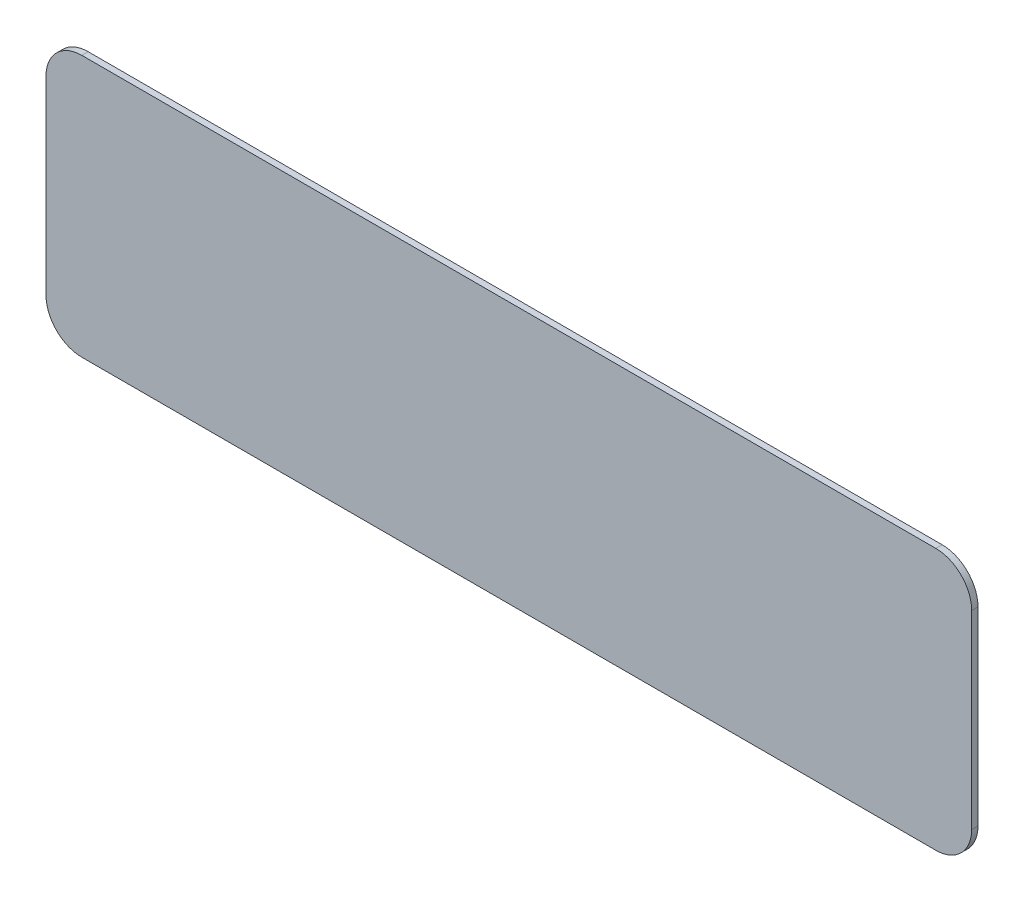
ISO-10303-21;
HEADER;
FILE_DESCRIPTION(('STEP AP214'),'2;1');
FILE_NAME('part.step','',(''),(''),'','','');
FILE_SCHEMA(('AUTOMOTIVE_DESIGN { 1 0 10303 214 1 1 1 1 }'));
ENDSEC;
DATA;
#1=APPLICATION_CONTEXT('core data for automotive mechanical design processes');
#2=APPLICATION_PROTOCOL_DEFINITION('international standard','automotive_design',2000,#1);
#3=PRODUCT_CONTEXT('',#1,'mechanical');
#4=PRODUCT('Part','Part','',(#3));
#5=PRODUCT_RELATED_PRODUCT_CATEGORY('part','',(#4));
#6=PRODUCT_DEFINITION_FORMATION('','',#4);
#7=PRODUCT_DEFINITION_CONTEXT('part definition',#1,'design');
#8=PRODUCT_DEFINITION('design','',#6,#7);
#9=PRODUCT_DEFINITION_SHAPE('','',#8);
#10=(LENGTH_UNIT() NAMED_UNIT(*) SI_UNIT(.MILLI.,.METRE.));
#11=(NAMED_UNIT(*) PLANE_ANGLE_UNIT() SI_UNIT($,.RADIAN.));
#12=(NAMED_UNIT(*) SI_UNIT($,.STERADIAN.) SOLID_ANGLE_UNIT());
#13=UNCERTAINTY_MEASURE_WITH_UNIT(LENGTH_MEASURE(1.E-05),#10,'distance_accuracy_value','');
#14=(GEOMETRIC_REPRESENTATION_CONTEXT(3) GLOBAL_UNCERTAINTY_ASSIGNED_CONTEXT((#13)) GLOBAL_UNIT_ASSIGNED_CONTEXT((#10,
#11,#12)) REPRESENTATION_CONTEXT('',''));
#15=CARTESIAN_POINT('',(0.,0.,0.));
#16=DIRECTION('',(0.,0.,1.));
#17=DIRECTION('',(1.,0.,0.));
#18=AXIS2_PLACEMENT_3D('',#15,#16,#17);
#19=CARTESIAN_POINT('',(0.,0.,0.6));
#20=DIRECTION('',(0.,0.,1.));
#21=DIRECTION('',(1.,0.,0.));
#22=AXIS2_PLACEMENT_3D('',#19,#20,#21);
#23=PLANE('',#22);
#24=DIRECTION('',(0.,-1.,0.));
#25=VECTOR('',#24,1.);
#26=CARTESIAN_POINT('',(-43.9,3.96,0.6));
#27=LINE('',#26,#25);
#28=CARTESIAN_POINT('',(-43.9,3.96,0.6));
#29=VERTEX_POINT('',#28);
#30=CARTESIAN_POINT('',(-43.9,-14.04,0.6));
#31=VERTEX_POINT('',#30);
#32=EDGE_CURVE('E11',#29,#31,#27,.T.);
#33=ORIENTED_EDGE('',*,*,#32,.T.);
#34=CARTESIAN_POINT('',(-40.5,-14.04,0.6));
#35=DIRECTION('',(0.,0.,1.));
#36=DIRECTION('',(-1.,0.,0.));
#37=AXIS2_PLACEMENT_3D('',#34,#35,#36);
#38=CIRCLE('',#37,3.4);
#39=CARTESIAN_POINT('',(-40.5,-17.44,0.6));
#40=VERTEX_POINT('',#39);
#41=EDGE_CURVE('E46',#31,#40,#38,.T.);
#42=ORIENTED_EDGE('',*,*,#41,.T.);
#43=DIRECTION('',(1.,0.,0.));
#44=VECTOR('',#43,1.);
#45=CARTESIAN_POINT('',(-40.5,-17.44,0.6));
#46=LINE('',#45,#44);
#47=CARTESIAN_POINT('',(40.5,-17.44,0.6));
#48=VERTEX_POINT('',#47);
#49=EDGE_CURVE('E103',#40,#48,#46,.T.);
#50=ORIENTED_EDGE('',*,*,#49,.T.);
#51=CARTESIAN_POINT('',(40.5,-14.04,0.6));
#52=DIRECTION('',(0.,0.,1.));
#53=DIRECTION('',(0.,-1.,0.));
#54=AXIS2_PLACEMENT_3D('',#51,#52,#53);
#55=CIRCLE('',#54,3.4);
#56=CARTESIAN_POINT('',(43.9,-14.04,0.6));
#57=VERTEX_POINT('',#56);
#58=EDGE_CURVE('E97',#48,#57,#55,.T.);
#59=ORIENTED_EDGE('',*,*,#58,.T.);
#60=DIRECTION('',(0.,1.,0.));
#61=VECTOR('',#60,1.);
#62=CARTESIAN_POINT('',(43.9,-14.04,0.6));
#63=LINE('',#62,#61);
#64=CARTESIAN_POINT('',(43.9,3.96,0.6));
#65=VERTEX_POINT('',#64);
#66=EDGE_CURVE('E100',#57,#65,#63,.T.);
#67=ORIENTED_EDGE('',*,*,#66,.T.);
#68=CARTESIAN_POINT('',(40.5,3.96,0.6));
#69=DIRECTION('',(0.,0.,1.));
#70=DIRECTION('',(1.,0.,0.));
#71=AXIS2_PLACEMENT_3D('',#68,#69,#70);
#72=CIRCLE('',#71,3.4);
#73=CARTESIAN_POINT('',(40.5,7.36,0.6));
#74=VERTEX_POINT('',#73);
#75=EDGE_CURVE('E130',#65,#74,#72,.T.);
#76=ORIENTED_EDGE('',*,*,#75,.T.);
#77=DIRECTION('',(-1.,0.,0.));
#78=VECTOR('',#77,1.);
#79=CARTESIAN_POINT('',(40.5,7.36,0.6));
#80=LINE('',#79,#78);
#81=CARTESIAN_POINT('',(-40.5,7.36,0.6));
#82=VERTEX_POINT('',#81);
#83=EDGE_CURVE('E229',#74,#82,#80,.T.);
#84=ORIENTED_EDGE('',*,*,#83,.T.);
#85=CARTESIAN_POINT('',(-40.5,3.96,0.6));
#86=DIRECTION('',(0.,0.,1.));
#87=DIRECTION('',(0.,1.,0.));
#88=AXIS2_PLACEMENT_3D('',#85,#86,#87);
#89=CIRCLE('',#88,3.4);
#90=EDGE_CURVE('E230',#82,#29,#89,.T.);
#91=ORIENTED_EDGE('',*,*,#90,.T.);
#92=EDGE_LOOP('',(#33,#42,#50,#59,#67,#76,#84,#91));
#93=FACE_BOUND('',#92,.T.);
#94=ADVANCED_FACE('F17',(#93),#23,.T.);
#95=CARTESIAN_POINT('',(-43.9,7.36,0.));
#96=DIRECTION('',(-1.,0.,0.));
#97=DIRECTION('',(0.,0.,1.));
#98=AXIS2_PLACEMENT_3D('',#95,#96,#97);
#99=PLANE('',#98);
#100=DIRECTION('',(0.,-1.,0.));
#101=VECTOR('',#100,1.);
#102=CARTESIAN_POINT('',(-43.9,3.96,0.));
#103=LINE('',#102,#101);
#104=CARTESIAN_POINT('',(-43.9,3.96,0.));
#105=VERTEX_POINT('',#104);
#106=CARTESIAN_POINT('',(-43.9,-14.04,0.));
#107=VERTEX_POINT('',#106);
#108=EDGE_CURVE('E161',#105,#107,#103,.T.);
#109=ORIENTED_EDGE('',*,*,#108,.T.);
#110=DIRECTION('',(0.,0.,-1.));
#111=VECTOR('',#110,1.);
#112=CARTESIAN_POINT('',(-43.9,-14.04,0.6));
#113=LINE('',#112,#111);
#114=EDGE_CURVE('E26',#31,#107,#113,.T.);
#115=ORIENTED_EDGE('',*,*,#114,.F.);
#116=ORIENTED_EDGE('',*,*,#32,.F.);
#117=DIRECTION('',(0.,0.,-1.));
#118=VECTOR('',#117,1.);
#119=CARTESIAN_POINT('',(-43.9,3.96,0.6));
#120=LINE('',#119,#118);
#121=EDGE_CURVE('E163',#29,#105,#120,.T.);
#122=ORIENTED_EDGE('',*,*,#121,.T.);
#123=EDGE_LOOP('',(#109,#115,#116,#122));
#124=FACE_BOUND('',#123,.T.);
#125=ADVANCED_FACE('F19',(#124),#99,.T.);
#126=CARTESIAN_POINT('',(-40.5,-14.04,4.74888));
#127=DIRECTION('',(0.,0.,-1.));
#128=DIRECTION('',(0.,-1.,0.));
#129=AXIS2_PLACEMENT_3D('',#126,#127,#128);
#130=CYLINDRICAL_SURFACE('',#129,3.4);
#131=DIRECTION('',(0.,0.,-1.));
#132=VECTOR('',#131,1.);
#133=CARTESIAN_POINT('',(-40.5,-17.44,0.6));
#134=LINE('',#133,#132);
#135=CARTESIAN_POINT('',(-40.5,-17.44,0.));
#136=VERTEX_POINT('',#135);
#137=EDGE_CURVE('E138',#40,#136,#134,.T.);
#138=ORIENTED_EDGE('',*,*,#137,.F.);
#139=ORIENTED_EDGE('',*,*,#41,.F.);
#140=ORIENTED_EDGE('',*,*,#114,.T.);
#141=CARTESIAN_POINT('',(-40.5,-14.04,0.));
#142=DIRECTION('',(0.,0.,-1.));
#143=DIRECTION('',(0.,-1.,0.));
#144=AXIS2_PLACEMENT_3D('',#141,#142,#143);
#145=CIRCLE('',#144,3.4);
#146=EDGE_CURVE('E153',#136,#107,#145,.T.);
#147=ORIENTED_EDGE('',*,*,#146,.F.);
#148=EDGE_LOOP('',(#138,#139,#140,#147));
#149=FACE_BOUND('',#148,.T.);
#150=ADVANCED_FACE('F150',(#149),#130,.T.);
#151=CARTESIAN_POINT('',(-43.9,-17.44,0.));
#152=DIRECTION('',(0.,-1.,0.));
#153=DIRECTION('',(0.,0.,-1.));
#154=AXIS2_PLACEMENT_3D('',#151,#152,#153);
#155=PLANE('',#154);
#156=DIRECTION('',(1.,0.,0.));
#157=VECTOR('',#156,1.);
#158=CARTESIAN_POINT('',(-40.5,-17.44,0.));
#159=LINE('',#158,#157);
#160=CARTESIAN_POINT('',(40.5,-17.44,0.));
#161=VERTEX_POINT('',#160);
#162=EDGE_CURVE('E173',#136,#161,#159,.T.);
#163=ORIENTED_EDGE('',*,*,#162,.T.);
#164=DIRECTION('',(0.,0.,-1.));
#165=VECTOR('',#164,1.);
#166=CARTESIAN_POINT('',(40.5,-17.44,0.6));
#167=LINE('',#166,#165);
#168=EDGE_CURVE('E108',#48,#161,#167,.T.);
#169=ORIENTED_EDGE('',*,*,#168,.F.);
#170=ORIENTED_EDGE('',*,*,#49,.F.);
#171=ORIENTED_EDGE('',*,*,#137,.T.);
#172=EDGE_LOOP('',(#163,#169,#170,#171));
#173=FACE_BOUND('',#172,.T.);
#174=ADVANCED_FACE('F406',(#173),#155,.T.);
#175=CARTESIAN_POINT('',(40.5,-14.04,4.74888));
#176=DIRECTION('',(0.,0.,-1.));
#177=DIRECTION('',(1.,0.,0.));
#178=AXIS2_PLACEMENT_3D('',#175,#176,#177);
#179=CYLINDRICAL_SURFACE('',#178,3.4);
#180=DIRECTION('',(0.,0.,-1.));
#181=VECTOR('',#180,1.);
#182=CARTESIAN_POINT('',(43.9,-14.04,0.6));
#183=LINE('',#182,#181);
#184=CARTESIAN_POINT('',(43.9,-14.04,0.));
#185=VERTEX_POINT('',#184);
#186=EDGE_CURVE('E109',#57,#185,#183,.T.);
#187=ORIENTED_EDGE('',*,*,#186,.F.);
#188=ORIENTED_EDGE('',*,*,#58,.F.);
#189=ORIENTED_EDGE('',*,*,#168,.T.);
#190=CARTESIAN_POINT('',(40.5,-14.04,0.));
#191=DIRECTION('',(0.,0.,-1.));
#192=DIRECTION('',(1.,0.,0.));
#193=AXIS2_PLACEMENT_3D('',#190,#191,#192);
#194=CIRCLE('',#193,3.4);
#195=EDGE_CURVE('E116',#185,#161,#194,.T.);
#196=ORIENTED_EDGE('',*,*,#195,.F.);
#197=EDGE_LOOP('',(#187,#188,#189,#196));
#198=FACE_BOUND('',#197,.T.);
#199=ADVANCED_FACE('F113',(#198),#179,.T.);
#200=CARTESIAN_POINT('',(43.9,-17.44,0.));
#201=DIRECTION('',(1.,0.,0.));
#202=DIRECTION('',(0.,1.,0.));
#203=AXIS2_PLACEMENT_3D('',#200,#201,#202);
#204=PLANE('',#203);
#205=DIRECTION('',(0.,1.,0.));
#206=VECTOR('',#205,1.);
#207=CARTESIAN_POINT('',(43.9,-14.04,0.));
#208=LINE('',#207,#206);
#209=CARTESIAN_POINT('',(43.9,3.96,0.));
#210=VERTEX_POINT('',#209);
#211=EDGE_CURVE('E373',#185,#210,#208,.T.);
#212=ORIENTED_EDGE('',*,*,#211,.T.);
#213=DIRECTION('',(0.,0.,-1.));
#214=VECTOR('',#213,1.);
#215=CARTESIAN_POINT('',(43.9,3.96,0.6));
#216=LINE('',#215,#214);
#217=EDGE_CURVE('E124',#65,#210,#216,.T.);
#218=ORIENTED_EDGE('',*,*,#217,.F.);
#219=ORIENTED_EDGE('',*,*,#66,.F.);
#220=ORIENTED_EDGE('',*,*,#186,.T.);
#221=EDGE_LOOP('',(#212,#218,#219,#220));
#222=FACE_BOUND('',#221,.T.);
#223=ADVANCED_FACE('F122',(#222),#204,.T.);
#224=CARTESIAN_POINT('',(40.5,3.96,4.74888));
#225=DIRECTION('',(0.,0.,-1.));
#226=DIRECTION('',(0.,1.,0.));
#227=AXIS2_PLACEMENT_3D('',#224,#225,#226);
#228=CYLINDRICAL_SURFACE('',#227,3.4);
#229=DIRECTION('',(0.,0.,-1.));
#230=VECTOR('',#229,1.);
#231=CARTESIAN_POINT('',(40.5,7.36,0.6));
#232=LINE('',#231,#230);
#233=CARTESIAN_POINT('',(40.5,7.36,0.));
#234=VERTEX_POINT('',#233);
#235=EDGE_CURVE('E238',#74,#234,#232,.T.);
#236=ORIENTED_EDGE('',*,*,#235,.F.);
#237=ORIENTED_EDGE('',*,*,#75,.F.);
#238=ORIENTED_EDGE('',*,*,#217,.T.);
#239=CARTESIAN_POINT('',(40.5,3.96,0.));
#240=DIRECTION('',(0.,0.,-1.));
#241=DIRECTION('',(0.,1.,0.));
#242=AXIS2_PLACEMENT_3D('',#239,#240,#241);
#243=CIRCLE('',#242,3.4);
#244=EDGE_CURVE('E376',#234,#210,#243,.T.);
#245=ORIENTED_EDGE('',*,*,#244,.F.);
#246=EDGE_LOOP('',(#236,#237,#238,#245));
#247=FACE_BOUND('',#246,.T.);
#248=ADVANCED_FACE('F343',(#247),#228,.T.);
#249=CARTESIAN_POINT('',(43.9,7.36,0.));
#250=DIRECTION('',(0.,1.,0.));
#251=DIRECTION('',(1.,0.,0.));
#252=AXIS2_PLACEMENT_3D('',#249,#250,#251);
#253=PLANE('',#252);
#254=ORIENTED_EDGE('',*,*,#83,.F.);
#255=ORIENTED_EDGE('',*,*,#235,.T.);
#256=DIRECTION('',(-1.,0.,0.));
#257=VECTOR('',#256,1.);
#258=CARTESIAN_POINT('',(40.5,7.36,0.));
#259=LINE('',#258,#257);
#260=CARTESIAN_POINT('',(-40.5,7.36,0.));
#261=VERTEX_POINT('',#260);
#262=EDGE_CURVE('E269',#234,#261,#259,.T.);
#263=ORIENTED_EDGE('',*,*,#262,.T.);
#264=DIRECTION('',(0.,0.,-1.));
#265=VECTOR('',#264,1.);
#266=CARTESIAN_POINT('',(-40.5,7.36,0.6));
#267=LINE('',#266,#265);
#268=EDGE_CURVE('E225',#82,#261,#267,.T.);
#269=ORIENTED_EDGE('',*,*,#268,.F.);
#270=EDGE_LOOP('',(#254,#255,#263,#269));
#271=FACE_BOUND('',#270,.T.);
#272=ADVANCED_FACE('F267',(#271),#253,.T.);
#273=CARTESIAN_POINT('',(-40.5,3.96,4.74888));
#274=DIRECTION('',(0.,0.,-1.));
#275=DIRECTION('',(-1.,0.,0.));
#276=AXIS2_PLACEMENT_3D('',#273,#274,#275);
#277=CYLINDRICAL_SURFACE('',#276,3.4);
#278=ORIENTED_EDGE('',*,*,#121,.F.);
#279=ORIENTED_EDGE('',*,*,#90,.F.);
#280=ORIENTED_EDGE('',*,*,#268,.T.);
#281=CARTESIAN_POINT('',(-40.5,3.96,0.));
#282=DIRECTION('',(0.,0.,-1.));
#283=DIRECTION('',(-1.,0.,0.));
#284=AXIS2_PLACEMENT_3D('',#281,#282,#283);
#285=CIRCLE('',#284,3.4);
#286=EDGE_CURVE('E168',#105,#261,#285,.T.);
#287=ORIENTED_EDGE('',*,*,#286,.F.);
#288=EDGE_LOOP('',(#278,#279,#280,#287));
#289=FACE_BOUND('',#288,.T.);
#290=ADVANCED_FACE('F271',(#289),#277,.T.);
#291=CARTESIAN_POINT('',(37.5,0.,0.));
#292=DIRECTION('',(0.,0.,-1.));
#293=DIRECTION('',(0.,1.,0.));
#294=AXIS2_PLACEMENT_3D('',#291,#292,#293);
#295=CYLINDRICAL_SURFACE('',#294,4.);
#296=DIRECTION('',(0.,0.,1.));
#297=VECTOR('',#296,1.);
#298=CARTESIAN_POINT('',(37.5,4.,0.));
#299=LINE('',#298,#297);
#300=CARTESIAN_POINT('',(37.5,4.,0.));
#301=VERTEX_POINT('',#300);
#302=CARTESIAN_POINT('',(37.5,4.,0.03));
#303=VERTEX_POINT('',#302);
#304=EDGE_CURVE('E204',#301,#303,#299,.T.);
#305=ORIENTED_EDGE('',*,*,#304,.T.);
#306=CARTESIAN_POINT('',(37.5,0.,0.03));
#307=DIRECTION('',(0.,0.,-1.));
#308=DIRECTION('',(0.,-1.,0.));
#309=AXIS2_PLACEMENT_3D('',#306,#307,#308);
#310=CIRCLE('',#309,4.);
#311=CARTESIAN_POINT('',(37.5,-4.,0.03));
#312=VERTEX_POINT('',#311);
#313=EDGE_CURVE('E193',#312,#303,#310,.T.);
#314=ORIENTED_EDGE('',*,*,#313,.F.);
#315=DIRECTION('',(0.,0.,1.));
#316=VECTOR('',#315,1.);
#317=CARTESIAN_POINT('',(37.5,-4.,0.));
#318=LINE('',#317,#316);
#319=CARTESIAN_POINT('',(37.5,-4.,0.));
#320=VERTEX_POINT('',#319);
#321=EDGE_CURVE('E207',#320,#312,#318,.T.);
#322=ORIENTED_EDGE('',*,*,#321,.F.);
#323=CARTESIAN_POINT('',(37.5,0.,0.));
#324=DIRECTION('',(0.,0.,-1.));
#325=DIRECTION('',(0.,-1.,0.));
#326=AXIS2_PLACEMENT_3D('',#323,#324,#325);
#327=CIRCLE('',#326,4.);
#328=EDGE_CURVE('E183',#320,#301,#327,.T.);
#329=ORIENTED_EDGE('',*,*,#328,.T.);
#330=EDGE_LOOP('',(#305,#314,#322,#329));
#331=FACE_BOUND('',#330,.T.);
#332=ADVANCED_FACE('F349',(#331),#295,.F.);
#333=CARTESIAN_POINT('',(37.5,0.,0.));
#334=DIRECTION('',(0.,0.,-1.));
#335=DIRECTION('',(0.,1.,0.));
#336=AXIS2_PLACEMENT_3D('',#333,#334,#335);
#337=CYLINDRICAL_SURFACE('',#336,4.);
#338=ORIENTED_EDGE('',*,*,#321,.T.);
#339=CARTESIAN_POINT('',(37.5,0.,0.03));
#340=DIRECTION('',(0.,0.,-1.));
#341=DIRECTION('',(0.,1.,0.));
#342=AXIS2_PLACEMENT_3D('',#339,#340,#341);
#343=CIRCLE('',#342,4.);
#344=EDGE_CURVE('E197',#303,#312,#343,.T.);
#345=ORIENTED_EDGE('',*,*,#344,.F.);
#346=ORIENTED_EDGE('',*,*,#304,.F.);
#347=CARTESIAN_POINT('',(37.5,0.,0.));
#348=DIRECTION('',(0.,0.,-1.));
#349=DIRECTION('',(0.,1.,0.));
#350=AXIS2_PLACEMENT_3D('',#347,#348,#349);
#351=CIRCLE('',#350,4.);
#352=EDGE_CURVE('E199',#301,#320,#351,.T.);
#353=ORIENTED_EDGE('',*,*,#352,.T.);
#354=EDGE_LOOP('',(#338,#345,#346,#353));
#355=FACE_BOUND('',#354,.T.);
#356=ADVANCED_FACE('F352',(#355),#337,.F.);
#357=CARTESIAN_POINT('',(-37.5,0.,0.));
#358=DIRECTION('',(0.,0.,-1.));
#359=DIRECTION('',(0.,1.,0.));
#360=AXIS2_PLACEMENT_3D('',#357,#358,#359);
#361=CYLINDRICAL_SURFACE('',#360,4.);
#362=DIRECTION('',(0.,0.,1.));
#363=VECTOR('',#362,1.);
#364=CARTESIAN_POINT('',(-37.5,4.,0.));
#365=LINE('',#364,#363);
#366=CARTESIAN_POINT('',(-37.5,4.,0.));
#367=VERTEX_POINT('',#366);
#368=CARTESIAN_POINT('',(-37.5,4.,0.03));
#369=VERTEX_POINT('',#368);
#370=EDGE_CURVE('E251',#367,#369,#365,.T.);
#371=ORIENTED_EDGE('',*,*,#370,.T.);
#372=CARTESIAN_POINT('',(-37.5,0.,0.03));
#373=DIRECTION('',(0.,0.,-1.));
#374=DIRECTION('',(0.,-1.,0.));
#375=AXIS2_PLACEMENT_3D('',#372,#373,#374);
#376=CIRCLE('',#375,4.);
#377=CARTESIAN_POINT('',(-37.5,-4.,0.03));
#378=VERTEX_POINT('',#377);
#379=EDGE_CURVE('E221',#378,#369,#376,.T.);
#380=ORIENTED_EDGE('',*,*,#379,.F.);
#381=DIRECTION('',(0.,0.,1.));
#382=VECTOR('',#381,1.);
#383=CARTESIAN_POINT('',(-37.5,-4.,0.));
#384=LINE('',#383,#382);
#385=CARTESIAN_POINT('',(-37.5,-4.,0.));
#386=VERTEX_POINT('',#385);
#387=EDGE_CURVE('E248',#386,#378,#384,.T.);
#388=ORIENTED_EDGE('',*,*,#387,.F.);
#389=CARTESIAN_POINT('',(-37.5,0.,0.));
#390=DIRECTION('',(0.,0.,-1.));
#391=DIRECTION('',(0.,-1.,0.));
#392=AXIS2_PLACEMENT_3D('',#389,#390,#391);
#393=CIRCLE('',#392,4.);
#394=EDGE_CURVE('E184',#386,#367,#393,.T.);
#395=ORIENTED_EDGE('',*,*,#394,.T.);
#396=EDGE_LOOP('',(#371,#380,#388,#395));
#397=FACE_BOUND('',#396,.T.);
#398=ADVANCED_FACE('F316',(#397),#361,.F.);
#399=CARTESIAN_POINT('',(-37.5,0.,0.));
#400=DIRECTION('',(0.,0.,-1.));
#401=DIRECTION('',(0.,1.,0.));
#402=AXIS2_PLACEMENT_3D('',#399,#400,#401);
#403=CYLINDRICAL_SURFACE('',#402,4.);
#404=ORIENTED_EDGE('',*,*,#387,.T.);
#405=CARTESIAN_POINT('',(-37.5,0.,0.03));
#406=DIRECTION('',(0.,0.,-1.));
#407=DIRECTION('',(0.,1.,0.));
#408=AXIS2_PLACEMENT_3D('',#405,#406,#407);
#409=CIRCLE('',#408,4.);
#410=EDGE_CURVE('E198',#369,#378,#409,.T.);
#411=ORIENTED_EDGE('',*,*,#410,.F.);
#412=ORIENTED_EDGE('',*,*,#370,.F.);
#413=CARTESIAN_POINT('',(-37.5,0.,0.));
#414=DIRECTION('',(0.,0.,-1.));
#415=DIRECTION('',(0.,1.,0.));
#416=AXIS2_PLACEMENT_3D('',#413,#414,#415);
#417=CIRCLE('',#416,4.);
#418=EDGE_CURVE('E189',#367,#386,#417,.T.);
#419=ORIENTED_EDGE('',*,*,#418,.T.);
#420=EDGE_LOOP('',(#404,#411,#412,#419));
#421=FACE_BOUND('',#420,.T.);
#422=ADVANCED_FACE('F311',(#421),#403,.F.);
#423=CARTESIAN_POINT('',(0.,0.,0.03));
#424=DIRECTION('',(0.,0.,-1.));
#425=DIRECTION('',(0.,-1.,0.));
#426=AXIS2_PLACEMENT_3D('',#423,#424,#425);
#427=PLANE('',#426);
#428=ORIENTED_EDGE('',*,*,#313,.T.);
#429=ORIENTED_EDGE('',*,*,#344,.T.);
#430=EDGE_LOOP('',(#428,#429));
#431=FACE_BOUND('',#430,.T.);
#432=ADVANCED_FACE('F321',(#431),#427,.T.);
#433=CARTESIAN_POINT('',(0.,0.,0.03));
#434=DIRECTION('',(0.,0.,-1.));
#435=DIRECTION('',(0.,-1.,0.));
#436=AXIS2_PLACEMENT_3D('',#433,#434,#435);
#437=PLANE('',#436);
#438=ORIENTED_EDGE('',*,*,#379,.T.);
#439=ORIENTED_EDGE('',*,*,#410,.T.);
#440=EDGE_LOOP('',(#438,#439));
#441=FACE_BOUND('',#440,.T.);
#442=ADVANCED_FACE('F318',(#441),#437,.T.);
#443=CARTESIAN_POINT('',(0.,0.,0.03));
#444=DIRECTION('',(0.,0.,-1.));
#445=DIRECTION('',(0.,-1.,0.));
#446=AXIS2_PLACEMENT_3D('',#443,#444,#445);
#447=PLANE('',#446);
#448=CARTESIAN_POINT('',(0.,0.,0.03));
#449=DIRECTION('',(0.,0.,-1.));
#450=DIRECTION('',(0.,-1.,0.));
#451=AXIS2_PLACEMENT_3D('',#448,#449,#450);
#452=CIRCLE('',#451,3.75);
#453=CARTESIAN_POINT('',(0.,-3.75,0.03));
#454=VERTEX_POINT('',#453);
#455=CARTESIAN_POINT('',(0.,3.75,0.03));
#456=VERTEX_POINT('',#455);
#457=EDGE_CURVE('E234',#454,#456,#452,.T.);
#458=ORIENTED_EDGE('',*,*,#457,.T.);
#459=CARTESIAN_POINT('',(0.,0.,0.03));
#460=DIRECTION('',(0.,0.,-1.));
#461=DIRECTION('',(0.,1.,0.));
#462=AXIS2_PLACEMENT_3D('',#459,#460,#461);
#463=CIRCLE('',#462,3.75);
#464=EDGE_CURVE('E208',#456,#454,#463,.T.);
#465=ORIENTED_EDGE('',*,*,#464,.T.);
#466=EDGE_LOOP('',(#458,#465));
#467=FACE_BOUND('',#466,.T.);
#468=ADVANCED_FACE('F320',(#467),#447,.T.);
#469=CARTESIAN_POINT('',(0.,0.,0.));
#470=DIRECTION('',(0.,0.,-1.));
#471=DIRECTION('',(0.,1.,0.));
#472=AXIS2_PLACEMENT_3D('',#469,#470,#471);
#473=CYLINDRICAL_SURFACE('',#472,3.75);
#474=DIRECTION('',(0.,0.,1.));
#475=VECTOR('',#474,1.);
#476=CARTESIAN_POINT('',(0.,3.75,0.));
#477=LINE('',#476,#475);
#478=CARTESIAN_POINT('',(0.,3.75,0.));
#479=VERTEX_POINT('',#478);
#480=EDGE_CURVE('E212',#479,#456,#477,.T.);
#481=ORIENTED_EDGE('',*,*,#480,.T.);
#482=ORIENTED_EDGE('',*,*,#457,.F.);
#483=DIRECTION('',(0.,0.,1.));
#484=VECTOR('',#483,1.);
#485=CARTESIAN_POINT('',(0.,-3.75,0.));
#486=LINE('',#485,#484);
#487=CARTESIAN_POINT('',(0.,-3.75,0.));
#488=VERTEX_POINT('',#487);
#489=EDGE_CURVE('E213',#488,#454,#486,.T.);
#490=ORIENTED_EDGE('',*,*,#489,.F.);
#491=CARTESIAN_POINT('',(0.,0.,0.));
#492=DIRECTION('',(0.,0.,-1.));
#493=DIRECTION('',(0.,-1.,0.));
#494=AXIS2_PLACEMENT_3D('',#491,#492,#493);
#495=CIRCLE('',#494,3.75);
#496=EDGE_CURVE('E203',#488,#479,#495,.T.);
#497=ORIENTED_EDGE('',*,*,#496,.T.);
#498=EDGE_LOOP('',(#481,#482,#490,#497));
#499=FACE_BOUND('',#498,.T.);
#500=ADVANCED_FACE('F329',(#499),#473,.F.);
#501=CARTESIAN_POINT('',(0.,0.,0.));
#502=DIRECTION('',(0.,0.,-1.));
#503=DIRECTION('',(0.,1.,0.));
#504=AXIS2_PLACEMENT_3D('',#501,#502,#503);
#505=CYLINDRICAL_SURFACE('',#504,3.75);
#506=ORIENTED_EDGE('',*,*,#489,.T.);
#507=ORIENTED_EDGE('',*,*,#464,.F.);
#508=ORIENTED_EDGE('',*,*,#480,.F.);
#509=CARTESIAN_POINT('',(0.,0.,0.));
#510=DIRECTION('',(0.,0.,-1.));
#511=DIRECTION('',(0.,1.,0.));
#512=AXIS2_PLACEMENT_3D('',#509,#510,#511);
#513=CIRCLE('',#512,3.75);
#514=EDGE_CURVE('E217',#479,#488,#513,.T.);
#515=ORIENTED_EDGE('',*,*,#514,.T.);
#516=EDGE_LOOP('',(#506,#507,#508,#515));
#517=FACE_BOUND('',#516,.T.);
#518=ADVANCED_FACE('F347',(#517),#505,.F.);
#519=CARTESIAN_POINT('',(0.,0.,0.));
#520=DIRECTION('',(0.,0.,1.));
#521=DIRECTION('',(1.,0.,0.));
#522=AXIS2_PLACEMENT_3D('',#519,#520,#521);
#523=PLANE('',#522);
#524=ORIENTED_EDGE('',*,*,#496,.F.);
#525=ORIENTED_EDGE('',*,*,#514,.F.);
#526=EDGE_LOOP('',(#524,#525));
#527=FACE_BOUND('',#526,.T.);
#528=ORIENTED_EDGE('',*,*,#328,.F.);
#529=ORIENTED_EDGE('',*,*,#352,.F.);
#530=EDGE_LOOP('',(#528,#529));
#531=FACE_BOUND('',#530,.T.);
#532=ORIENTED_EDGE('',*,*,#394,.F.);
#533=ORIENTED_EDGE('',*,*,#418,.F.);
#534=EDGE_LOOP('',(#532,#533));
#535=FACE_BOUND('',#534,.T.);
#536=ORIENTED_EDGE('',*,*,#262,.F.);
#537=ORIENTED_EDGE('',*,*,#244,.T.);
#538=ORIENTED_EDGE('',*,*,#211,.F.);
#539=ORIENTED_EDGE('',*,*,#195,.T.);
#540=ORIENTED_EDGE('',*,*,#162,.F.);
#541=ORIENTED_EDGE('',*,*,#146,.T.);
#542=ORIENTED_EDGE('',*,*,#108,.F.);
#543=ORIENTED_EDGE('',*,*,#286,.T.);
#544=EDGE_LOOP('',(#536,#537,#538,#539,#540,#541,#542,#543));
#545=FACE_BOUND('',#544,.T.);
#546=ADVANCED_FACE('F171',(#527,#531,#535,#545),#523,.F.);
#547=CLOSED_SHELL('',(#94,#125,#150,#174,#199,#223,#248,#272,#290,#332,#356,#398,#422,#432,#442,
#468,#500,#518,#546));
#548=MANIFOLD_SOLID_BREP('B1',#547);
#549=ADVANCED_BREP_SHAPE_REPRESENTATION('',(#18,#548),#14);
#550=SHAPE_DEFINITION_REPRESENTATION(#9,#549);
ENDSEC;
END-ISO-10303-21;
